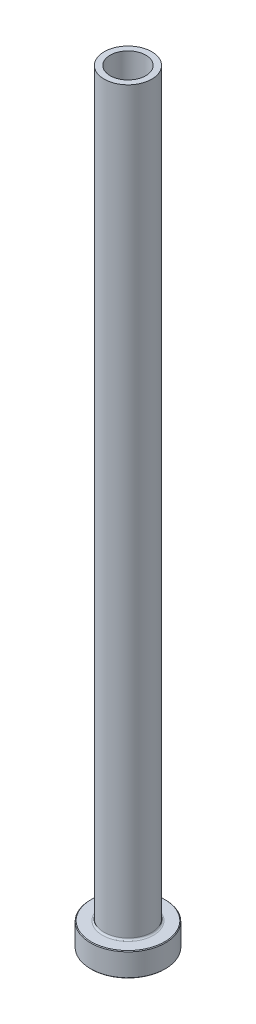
from build123d import *

# Parameters (mm, degrees)
FILLET1_R     = 0.5
CHAMFER1_SIZE = 0.2
CHAMFER3_SIZE = 0.5


with BuildPart() as part:
    # Sketch1 → Revolve1 (revolve)
    with BuildSketch(Plane.XY, mode=Mode.PRIVATE) as revolve1_sk:
        Polygon((-5.25, 225), (-7, 225), (-7, 7), (-11, 7), (-11, 0), (-5.5, 0), (-5.5, 158), (-5.25, 170), align=None)
    revolve(revolve1_sk.sketch.rotate(Axis((0, 92.187680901, 0), (0, -1, 0)), 270), axis=Axis((0, 92.187680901, 0), (0, -1, 0)))

    # Fillet1
    fillet1_edges = [part.edges().sort_by_distance(p)[0] for p in [
        (0, 7, -7),
    ]]
    fillet(fillet1_edges, radius=FILLET1_R)

    # Chamfer1
    chamfer1_edges = [part.edges().sort_by_distance(p)[0] for p in [
        (0, 0, -11),
        (0, 7, -11),
    ]]
    chamfer(chamfer1_edges, length=CHAMFER1_SIZE)

    # Chamfer3
    chamfer3_edges = [part.edges().sort_by_distance(p)[0] for p in [
        (0, 0, -5.5),
    ]]
    chamfer(chamfer3_edges, length=CHAMFER3_SIZE)


solid = part.part
